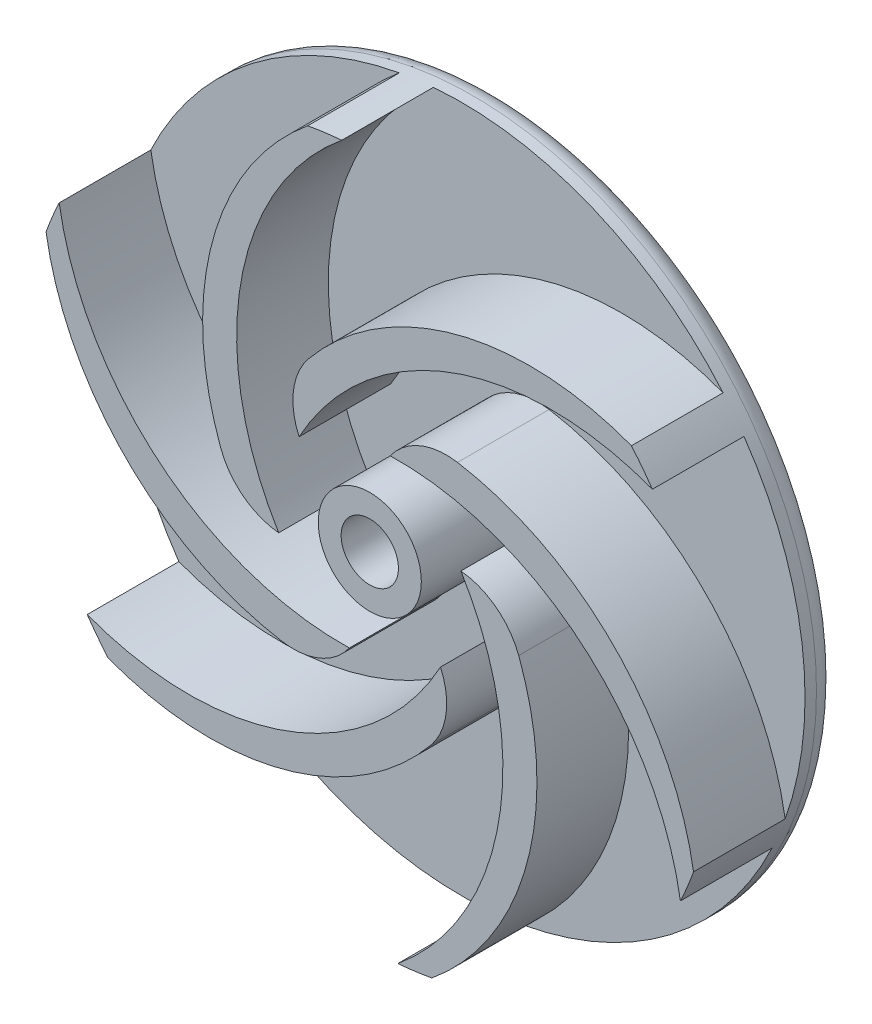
ISO-10303-21;
HEADER;
FILE_DESCRIPTION(('STEP AP214'),'2;1');
FILE_NAME('part.step','',(''),(''),'','','');
FILE_SCHEMA(('AUTOMOTIVE_DESIGN { 1 0 10303 214 1 1 1 1 }'));
ENDSEC;
DATA;
#1=APPLICATION_CONTEXT('core data for automotive mechanical design processes');
#2=APPLICATION_PROTOCOL_DEFINITION('international standard','automotive_design',2000,#1);
#3=PRODUCT_CONTEXT('',#1,'mechanical');
#4=PRODUCT('Part','Part','',(#3));
#5=PRODUCT_RELATED_PRODUCT_CATEGORY('part','',(#4));
#6=PRODUCT_DEFINITION_FORMATION('','',#4);
#7=PRODUCT_DEFINITION_CONTEXT('part definition',#1,'design');
#8=PRODUCT_DEFINITION('design','',#6,#7);
#9=PRODUCT_DEFINITION_SHAPE('','',#8);
#10=(LENGTH_UNIT() NAMED_UNIT(*) SI_UNIT(.MILLI.,.METRE.));
#11=(NAMED_UNIT(*) PLANE_ANGLE_UNIT() SI_UNIT($,.RADIAN.));
#12=(NAMED_UNIT(*) SI_UNIT($,.STERADIAN.) SOLID_ANGLE_UNIT());
#13=UNCERTAINTY_MEASURE_WITH_UNIT(LENGTH_MEASURE(1.E-05),#10,'distance_accuracy_value','');
#14=(GEOMETRIC_REPRESENTATION_CONTEXT(3) GLOBAL_UNCERTAINTY_ASSIGNED_CONTEXT((#13)) GLOBAL_UNIT_ASSIGNED_CONTEXT((#10,
#11,#12)) REPRESENTATION_CONTEXT('',''));
#15=CARTESIAN_POINT('',(0.,0.,0.));
#16=DIRECTION('',(0.,0.,1.));
#17=DIRECTION('',(1.,0.,0.));
#18=AXIS2_PLACEMENT_3D('',#15,#16,#17);
#19=CARTESIAN_POINT('',(0.,0.,1.5));
#20=DIRECTION('',(0.,0.,1.));
#21=DIRECTION('',(1.,0.,0.));
#22=AXIS2_PLACEMENT_3D('',#19,#20,#21);
#23=PLANE('',#22);
#24=CARTESIAN_POINT('',(0.,0.,1.5));
#25=DIRECTION('',(0.,0.,1.));
#26=DIRECTION('',(1.,0.,0.));
#27=AXIS2_PLACEMENT_3D('',#24,#25,#26);
#28=CIRCLE('',#27,2.25);
#29=CARTESIAN_POINT('',(2.25,0.,1.5));
#30=VERTEX_POINT('',#29);
#31=EDGE_CURVE('E334',#30,#30,#28,.T.);
#32=ORIENTED_EDGE('',*,*,#31,.F.);
#33=EDGE_LOOP('',(#32));
#34=FACE_BOUND('',#33,.T.);
#35=CARTESIAN_POINT('',(6.71906278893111,5.25914322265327,1.5));
#36=DIRECTION('',(0.,0.,-1.));
#37=DIRECTION('',(-0.50000000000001,-0.866025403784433,0.));
#38=AXIS2_PLACEMENT_3D('',#35,#36,#37);
#39=CIRCLE('',#38,12.5299640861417);
#40=CARTESIAN_POINT('',(-3.9770896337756,-1.26713621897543,1.5));
#41=VERTEX_POINT('',#40);
#42=CARTESIAN_POINT('',(-1.22368436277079,14.9500032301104,1.5));
#43=VERTEX_POINT('',#42);
#44=EDGE_CURVE('E758',#41,#43,#39,.T.);
#45=ORIENTED_EDGE('',*,*,#44,.F.);
#46=CARTESIAN_POINT('',(-3.69238428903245,1.7193237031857,1.5));
#47=DIRECTION('',(0.,0.,1.));
#48=DIRECTION('',(1.,0.,0.));
#49=AXIS2_PLACEMENT_3D('',#46,#47,#48);
#50=CIRCLE('',#49,3.);
#51=CARTESIAN_POINT('',(-6.5017658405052,0.667004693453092,1.5));
#52=VERTEX_POINT('',#51);
#53=EDGE_CURVE('E56',#41,#52,#50,.F.);
#54=ORIENTED_EDGE('',*,*,#53,.T.);
#55=CARTESIAN_POINT('',(5.23205080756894,5.06217782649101,1.5));
#56=DIRECTION('',(0.,0.,1.));
#57=DIRECTION('',(-0.50000000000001,-0.866025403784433,0.));
#58=AXIS2_PLACEMENT_3D('',#55,#56,#57);
#59=CIRCLE('',#58,12.5299640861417);
#60=CARTESIAN_POINT('',(-2.71069634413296,14.7530378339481,1.5));
#61=VERTEX_POINT('',#60);
#62=EDGE_CURVE('E452',#61,#52,#59,.T.);
#63=ORIENTED_EDGE('',*,*,#62,.F.);
#64=CARTESIAN_POINT('',(0.,0.,1.5));
#65=DIRECTION('',(0.,0.,1.));
#66=DIRECTION('',(1.,0.,0.));
#67=AXIS2_PLACEMENT_3D('',#64,#65,#66);
#68=CIRCLE('',#67,15.);
#69=CARTESIAN_POINT('',(-13.5589247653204,6.41525987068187,1.5));
#70=VERTEX_POINT('',#69);
#71=EDGE_CURVE('E352',#61,#70,#68,.T.);
#72=ORIENTED_EDGE('',*,*,#71,.T.);
#73=CARTESIAN_POINT('',(-1.19502023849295,8.44845067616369,1.5));
#74=DIRECTION('',(0.,0.,-1.));
#75=DIRECTION('',(0.499999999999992,-0.866025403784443,0.));
#76=AXIS2_PLACEMENT_3D('',#73,#74,#75);
#77=CIRCLE('',#76,12.5299640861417);
#78=CARTESIAN_POINT('',(-0.891172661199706,-4.07782876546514,1.5));
#79=VERTEX_POINT('',#78);
#80=EDGE_CURVE('E218',#79,#70,#77,.T.);
#81=ORIENTED_EDGE('',*,*,#80,.F.);
#82=CARTESIAN_POINT('',(-3.33517014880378,-2.33803674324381,1.5));
#83=DIRECTION('',(0.,0.,1.));
#84=DIRECTION('',(1.,0.,0.));
#85=AXIS2_PLACEMENT_3D('',#82,#83,#84);
#86=CIRCLE('',#85,3.);
#87=CARTESIAN_POINT('',(-3.82852592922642,-5.29719204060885,1.5));
#88=VERTEX_POINT('',#87);
#89=EDGE_CURVE('E380',#79,#88,#86,.F.);
#90=ORIENTED_EDGE('',*,*,#89,.T.);
#91=CARTESIAN_POINT('',(-1.76794919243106,7.06217782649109,1.5));
#92=DIRECTION('',(0.,0.,1.));
#93=DIRECTION('',(0.499999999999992,-0.866025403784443,0.));
#94=AXIS2_PLACEMENT_3D('',#91,#92,#93);
#95=CIRCLE('',#94,12.5299640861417);
#96=CARTESIAN_POINT('',(-14.1318537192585,5.02898702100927,1.5));
#97=VERTEX_POINT('',#96);
#98=EDGE_CURVE('E215',#97,#88,#95,.T.);
#99=ORIENTED_EDGE('',*,*,#98,.F.);
#100=CARTESIAN_POINT('',(-12.3352404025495,-8.5347433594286,1.5));
#101=VERTEX_POINT('',#100);
#102=EDGE_CURVE('E447',#97,#101,#68,.T.);
#103=ORIENTED_EDGE('',*,*,#102,.T.);
#104=CARTESIAN_POINT('',(-7.91408302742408,3.18930745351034,1.5));
#105=DIRECTION('',(0.,0.,-1.));
#106=DIRECTION('',(1.,0.,0.));
#107=AXIS2_PLACEMENT_3D('',#104,#105,#106);
#108=CIRCLE('',#107,12.5299640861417);
#109=CARTESIAN_POINT('',(3.08591697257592,-2.81069254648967,1.5));
#110=VERTEX_POINT('',#109);
#111=EDGE_CURVE('E247',#110,#101,#108,.T.);
#112=ORIENTED_EDGE('',*,*,#111,.F.);
#113=CARTESIAN_POINT('',(0.357214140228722,-4.0573604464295,1.5));
#114=DIRECTION('',(0.,0.,1.));
#115=DIRECTION('',(1.,0.,0.));
#116=AXIS2_PLACEMENT_3D('',#113,#114,#115);
#117=CIRCLE('',#116,3.);
#118=CARTESIAN_POINT('',(2.67323991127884,-5.9641967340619,1.5));
#119=VERTEX_POINT('',#118);
#120=EDGE_CURVE('E374',#110,#119,#117,.F.);
#121=ORIENTED_EDGE('',*,*,#120,.T.);
#122=CARTESIAN_POINT('',(-7.,2.,1.5));
#123=DIRECTION('',(0.,0.,1.));
#124=DIRECTION('',(1.,0.,0.));
#125=AXIS2_PLACEMENT_3D('',#122,#123,#124);
#126=CIRCLE('',#125,12.5299640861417);
#127=CARTESIAN_POINT('',(-11.4211573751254,-9.72405081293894,1.5));
#128=VERTEX_POINT('',#127);
#129=EDGE_CURVE('E242',#128,#119,#126,.T.);
#130=ORIENTED_EDGE('',*,*,#129,.F.);
#131=CARTESIAN_POINT('',(1.2236843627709,-14.9500032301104,1.5));
#132=VERTEX_POINT('',#131);
#133=EDGE_CURVE('E455',#128,#132,#68,.T.);
#134=ORIENTED_EDGE('',*,*,#133,.T.);
#135=CARTESIAN_POINT('',(-6.71906278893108,-5.25914322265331,1.5));
#136=DIRECTION('',(0.,0.,-1.));
#137=DIRECTION('',(0.500000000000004,0.866025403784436,0.));
#138=AXIS2_PLACEMENT_3D('',#135,#136,#137);
#139=CIRCLE('',#138,12.5299640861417);
#140=CARTESIAN_POINT('',(3.97708963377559,1.26713621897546,1.5));
#141=VERTEX_POINT('',#140);
#142=EDGE_CURVE('E269',#141,#132,#139,.T.);
#143=ORIENTED_EDGE('',*,*,#142,.F.);
#144=CARTESIAN_POINT('',(3.69238428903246,-1.71932370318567,1.5));
#145=DIRECTION('',(0.,0.,1.));
#146=DIRECTION('',(1.,0.,0.));
#147=AXIS2_PLACEMENT_3D('',#144,#145,#146);
#148=CIRCLE('',#147,3.);
#149=CARTESIAN_POINT('',(6.5017658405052,-0.667004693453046,1.5));
#150=VERTEX_POINT('',#149);
#151=EDGE_CURVE('E368',#141,#150,#148,.F.);
#152=ORIENTED_EDGE('',*,*,#151,.T.);
#153=CARTESIAN_POINT('',(-5.2320508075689,-5.06217782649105,1.5));
#154=DIRECTION('',(0.,0.,1.));
#155=DIRECTION('',(0.500000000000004,0.866025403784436,0.));
#156=AXIS2_PLACEMENT_3D('',#153,#154,#155);
#157=CIRCLE('',#156,12.5299640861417);
#158=CARTESIAN_POINT('',(2.71069634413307,-14.7530378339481,1.5));
#159=VERTEX_POINT('',#158);
#160=EDGE_CURVE('E264',#159,#150,#157,.T.);
#161=ORIENTED_EDGE('',*,*,#160,.F.);
#162=CARTESIAN_POINT('',(13.5589247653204,-6.41525987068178,1.5));
#163=VERTEX_POINT('',#162);
#164=EDGE_CURVE('E456',#159,#163,#68,.T.);
#165=ORIENTED_EDGE('',*,*,#164,.T.);
#166=CARTESIAN_POINT('',(1.19502023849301,-8.44845067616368,1.5));
#167=DIRECTION('',(0.,0.,-1.));
#168=DIRECTION('',(-0.499999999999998,0.86602540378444,0.));
#169=AXIS2_PLACEMENT_3D('',#166,#167,#168);
#170=CIRCLE('',#169,12.5299640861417);
#171=CARTESIAN_POINT('',(0.891172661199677,4.07782876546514,1.5));
#172=VERTEX_POINT('',#171);
#173=EDGE_CURVE('E291',#172,#163,#170,.T.);
#174=ORIENTED_EDGE('',*,*,#173,.F.);
#175=CARTESIAN_POINT('',(3.33517014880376,2.33803674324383,1.5));
#176=DIRECTION('',(0.,0.,1.));
#177=DIRECTION('',(1.,0.,0.));
#178=AXIS2_PLACEMENT_3D('',#175,#176,#177);
#179=CIRCLE('',#178,3.);
#180=CARTESIAN_POINT('',(3.82852592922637,5.29719204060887,1.5));
#181=VERTEX_POINT('',#180);
#182=EDGE_CURVE('E362',#172,#181,#179,.F.);
#183=ORIENTED_EDGE('',*,*,#182,.T.);
#184=CARTESIAN_POINT('',(1.76794919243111,-7.06217782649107,1.5));
#185=DIRECTION('',(0.,0.,1.));
#186=DIRECTION('',(-0.499999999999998,0.86602540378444,0.));
#187=AXIS2_PLACEMENT_3D('',#184,#185,#186);
#188=CIRCLE('',#187,12.5299640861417);
#189=CARTESIAN_POINT('',(14.1318537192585,-5.02898702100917,1.5));
#190=VERTEX_POINT('',#189);
#191=EDGE_CURVE('E286',#190,#181,#188,.T.);
#192=ORIENTED_EDGE('',*,*,#191,.F.);
#193=CARTESIAN_POINT('',(12.3352404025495,8.5347433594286,1.5));
#194=VERTEX_POINT('',#193);
#195=EDGE_CURVE('E348',#190,#194,#68,.T.);
#196=ORIENTED_EDGE('',*,*,#195,.T.);
#197=CARTESIAN_POINT('',(7.91408302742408,-3.18930745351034,1.5));
#198=DIRECTION('',(0.,0.,-1.));
#199=DIRECTION('',(-1.,0.,0.));
#200=AXIS2_PLACEMENT_3D('',#197,#198,#199);
#201=CIRCLE('',#200,12.5299640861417);
#202=CARTESIAN_POINT('',(-3.08591697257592,2.81069254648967,1.5));
#203=VERTEX_POINT('',#202);
#204=EDGE_CURVE('E313',#203,#194,#201,.T.);
#205=ORIENTED_EDGE('',*,*,#204,.F.);
#206=CARTESIAN_POINT('',(-0.357214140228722,4.0573604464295,1.5));
#207=DIRECTION('',(0.,0.,1.));
#208=DIRECTION('',(1.,0.,0.));
#209=AXIS2_PLACEMENT_3D('',#206,#207,#208);
#210=CIRCLE('',#209,3.);
#211=CARTESIAN_POINT('',(-2.67323991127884,5.9641967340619,1.5));
#212=VERTEX_POINT('',#211);
#213=EDGE_CURVE('E356',#203,#212,#210,.F.);
#214=ORIENTED_EDGE('',*,*,#213,.T.);
#215=CARTESIAN_POINT('',(7.,-2.,1.5));
#216=DIRECTION('',(0.,0.,1.));
#217=DIRECTION('',(-1.,0.,0.));
#218=AXIS2_PLACEMENT_3D('',#215,#216,#217);
#219=CIRCLE('',#218,12.5299640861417);
#220=CARTESIAN_POINT('',(11.4211573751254,9.72405081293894,1.5));
#221=VERTEX_POINT('',#220);
#222=EDGE_CURVE('E308',#221,#212,#219,.T.);
#223=ORIENTED_EDGE('',*,*,#222,.F.);
#224=EDGE_CURVE('E349',#221,#43,#68,.T.);
#225=ORIENTED_EDGE('',*,*,#224,.T.);
#226=EDGE_LOOP('',(#45,#54,#63,#72,#81,#90,#99,#103,#112,#121,#130,#134,#143,#152,#161,#165,
#174,#183,#192,#196,#205,#214,#223,#225));
#227=FACE_BOUND('',#226,.T.);
#228=ADVANCED_FACE('F33',(#34,#227),#23,.T.);
#229=CARTESIAN_POINT('',(0.,0.,0.));
#230=DIRECTION('',(0.,0.,1.));
#231=DIRECTION('',(1.,0.,0.));
#232=AXIS2_PLACEMENT_3D('',#229,#230,#231);
#233=PLANE('',#232);
#234=CARTESIAN_POINT('',(0.,0.,0.));
#235=DIRECTION('',(0.,0.,1.));
#236=DIRECTION('',(1.,0.,0.));
#237=AXIS2_PLACEMENT_3D('',#234,#235,#236);
#238=CIRCLE('',#237,14.);
#239=CARTESIAN_POINT('',(14.,0.,0.));
#240=VERTEX_POINT('',#239);
#241=EDGE_CURVE('E11',#240,#240,#238,.F.);
#242=ORIENTED_EDGE('',*,*,#241,.T.);
#243=EDGE_LOOP('',(#242));
#244=FACE_BOUND('',#243,.T.);
#245=CARTESIAN_POINT('',(0.,0.,0.));
#246=DIRECTION('',(0.,0.,1.));
#247=DIRECTION('',(1.,0.,0.));
#248=AXIS2_PLACEMENT_3D('',#245,#246,#247);
#249=CIRCLE('',#248,1.5);
#250=CARTESIAN_POINT('',(1.5,0.,0.));
#251=VERTEX_POINT('',#250);
#252=EDGE_CURVE('E345',#251,#251,#249,.T.);
#253=ORIENTED_EDGE('',*,*,#252,.T.);
#254=EDGE_LOOP('',(#253));
#255=FACE_BOUND('',#254,.T.);
#256=ADVANCED_FACE('F397',(#244,#255),#233,.F.);
#257=CARTESIAN_POINT('',(0.,0.,1.5));
#258=DIRECTION('',(0.,0.,-1.));
#259=DIRECTION('',(-1.,0.,0.));
#260=AXIS2_PLACEMENT_3D('',#257,#258,#259);
#261=CYLINDRICAL_SURFACE('',#260,15.);
#262=CARTESIAN_POINT('',(0.,0.,1.));
#263=DIRECTION('',(0.,0.,1.));
#264=DIRECTION('',(1.,0.,0.));
#265=AXIS2_PLACEMENT_3D('',#262,#263,#264);
#266=CIRCLE('',#265,15.);
#267=CARTESIAN_POINT('',(15.,0.,1.));
#268=VERTEX_POINT('',#267);
#269=EDGE_CURVE('E41',#268,#268,#266,.T.);
#270=ORIENTED_EDGE('',*,*,#269,.T.);
#271=EDGE_LOOP('',(#270));
#272=FACE_BOUND('',#271,.T.);
#273=ORIENTED_EDGE('',*,*,#224,.F.);
#274=DIRECTION('',(0.,0.,-1.));
#275=VECTOR('',#274,1.);
#276=CARTESIAN_POINT('',(11.4211573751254,9.72405081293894,5.5));
#277=LINE('',#276,#275);
#278=CARTESIAN_POINT('',(11.4211573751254,9.72405081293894,5.5));
#279=VERTEX_POINT('',#278);
#280=EDGE_CURVE('E317',#279,#221,#277,.T.);
#281=ORIENTED_EDGE('',*,*,#280,.F.);
#282=CARTESIAN_POINT('',(0.,0.,5.5));
#283=DIRECTION('',(0.,0.,1.));
#284=DIRECTION('',(-1.,0.,0.));
#285=AXIS2_PLACEMENT_3D('',#282,#283,#284);
#286=CIRCLE('',#285,15.);
#287=CARTESIAN_POINT('',(12.3352404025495,8.5347433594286,5.5));
#288=VERTEX_POINT('',#287);
#289=EDGE_CURVE('E315',#288,#279,#286,.T.);
#290=ORIENTED_EDGE('',*,*,#289,.F.);
#291=DIRECTION('',(0.,0.,-1.));
#292=VECTOR('',#291,1.);
#293=CARTESIAN_POINT('',(12.3352404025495,8.5347433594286,5.5));
#294=LINE('',#293,#292);
#295=EDGE_CURVE('E324',#288,#194,#294,.T.);
#296=ORIENTED_EDGE('',*,*,#295,.T.);
#297=ORIENTED_EDGE('',*,*,#195,.F.);
#298=DIRECTION('',(0.,0.,-1.));
#299=VECTOR('',#298,1.);
#300=CARTESIAN_POINT('',(14.1318537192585,-5.02898702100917,5.5));
#301=LINE('',#300,#299);
#302=CARTESIAN_POINT('',(14.1318537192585,-5.02898702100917,5.5));
#303=VERTEX_POINT('',#302);
#304=EDGE_CURVE('E295',#303,#190,#301,.T.);
#305=ORIENTED_EDGE('',*,*,#304,.F.);
#306=CARTESIAN_POINT('',(0.,0.,5.5));
#307=DIRECTION('',(0.,0.,1.));
#308=DIRECTION('',(-0.499999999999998,0.86602540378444,0.));
#309=AXIS2_PLACEMENT_3D('',#306,#307,#308);
#310=CIRCLE('',#309,15.);
#311=CARTESIAN_POINT('',(13.5589247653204,-6.41525987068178,5.5));
#312=VERTEX_POINT('',#311);
#313=EDGE_CURVE('E293',#312,#303,#310,.T.);
#314=ORIENTED_EDGE('',*,*,#313,.F.);
#315=DIRECTION('',(0.,0.,-1.));
#316=VECTOR('',#315,1.);
#317=CARTESIAN_POINT('',(13.5589247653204,-6.41525987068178,5.5));
#318=LINE('',#317,#316);
#319=EDGE_CURVE('E302',#312,#163,#318,.T.);
#320=ORIENTED_EDGE('',*,*,#319,.T.);
#321=ORIENTED_EDGE('',*,*,#164,.F.);
#322=DIRECTION('',(0.,0.,-1.));
#323=VECTOR('',#322,1.);
#324=CARTESIAN_POINT('',(2.71069634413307,-14.7530378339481,5.5));
#325=LINE('',#324,#323);
#326=CARTESIAN_POINT('',(2.71069634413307,-14.7530378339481,5.5));
#327=VERTEX_POINT('',#326);
#328=EDGE_CURVE('E273',#327,#159,#325,.T.);
#329=ORIENTED_EDGE('',*,*,#328,.F.);
#330=CARTESIAN_POINT('',(0.,0.,5.5));
#331=DIRECTION('',(0.,0.,1.));
#332=DIRECTION('',(0.500000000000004,0.866025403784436,0.));
#333=AXIS2_PLACEMENT_3D('',#330,#331,#332);
#334=CIRCLE('',#333,15.);
#335=CARTESIAN_POINT('',(1.2236843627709,-14.9500032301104,5.5));
#336=VERTEX_POINT('',#335);
#337=EDGE_CURVE('E271',#336,#327,#334,.T.);
#338=ORIENTED_EDGE('',*,*,#337,.F.);
#339=DIRECTION('',(0.,0.,-1.));
#340=VECTOR('',#339,1.);
#341=CARTESIAN_POINT('',(1.2236843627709,-14.9500032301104,5.5));
#342=LINE('',#341,#340);
#343=EDGE_CURVE('E280',#336,#132,#342,.T.);
#344=ORIENTED_EDGE('',*,*,#343,.T.);
#345=ORIENTED_EDGE('',*,*,#133,.F.);
#346=DIRECTION('',(0.,0.,-1.));
#347=VECTOR('',#346,1.);
#348=CARTESIAN_POINT('',(-11.4211573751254,-9.72405081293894,5.5));
#349=LINE('',#348,#347);
#350=CARTESIAN_POINT('',(-11.4211573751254,-9.72405081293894,5.5));
#351=VERTEX_POINT('',#350);
#352=EDGE_CURVE('E251',#351,#128,#349,.T.);
#353=ORIENTED_EDGE('',*,*,#352,.F.);
#354=CARTESIAN_POINT('',(0.,0.,5.5));
#355=DIRECTION('',(0.,0.,1.));
#356=DIRECTION('',(1.,0.,0.));
#357=AXIS2_PLACEMENT_3D('',#354,#355,#356);
#358=CIRCLE('',#357,15.);
#359=CARTESIAN_POINT('',(-12.3352404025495,-8.5347433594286,5.5));
#360=VERTEX_POINT('',#359);
#361=EDGE_CURVE('E249',#360,#351,#358,.T.);
#362=ORIENTED_EDGE('',*,*,#361,.F.);
#363=DIRECTION('',(0.,0.,-1.));
#364=VECTOR('',#363,1.);
#365=CARTESIAN_POINT('',(-12.3352404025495,-8.5347433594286,5.5));
#366=LINE('',#365,#364);
#367=EDGE_CURVE('E258',#360,#101,#366,.T.);
#368=ORIENTED_EDGE('',*,*,#367,.T.);
#369=ORIENTED_EDGE('',*,*,#102,.F.);
#370=DIRECTION('',(0.,0.,-1.));
#371=VECTOR('',#370,1.);
#372=CARTESIAN_POINT('',(-14.1318537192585,5.02898702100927,5.5));
#373=LINE('',#372,#371);
#374=CARTESIAN_POINT('',(-14.1318537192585,5.02898702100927,5.5));
#375=VERTEX_POINT('',#374);
#376=EDGE_CURVE('E230',#375,#97,#373,.T.);
#377=ORIENTED_EDGE('',*,*,#376,.F.);
#378=CARTESIAN_POINT('',(0.,0.,5.5));
#379=DIRECTION('',(0.,0.,1.));
#380=DIRECTION('',(0.499999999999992,-0.866025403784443,0.));
#381=AXIS2_PLACEMENT_3D('',#378,#379,#380);
#382=CIRCLE('',#381,15.);
#383=CARTESIAN_POINT('',(-13.5589247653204,6.41525987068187,5.5));
#384=VERTEX_POINT('',#383);
#385=EDGE_CURVE('E229',#384,#375,#382,.T.);
#386=ORIENTED_EDGE('',*,*,#385,.F.);
#387=DIRECTION('',(0.,0.,-1.));
#388=VECTOR('',#387,1.);
#389=CARTESIAN_POINT('',(-13.5589247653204,6.41525987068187,5.5));
#390=LINE('',#389,#388);
#391=EDGE_CURVE('E236',#384,#70,#390,.T.);
#392=ORIENTED_EDGE('',*,*,#391,.T.);
#393=ORIENTED_EDGE('',*,*,#71,.F.);
#394=DIRECTION('',(0.,0.,-1.));
#395=VECTOR('',#394,1.);
#396=CARTESIAN_POINT('',(-2.71069634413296,14.7530378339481,5.5));
#397=LINE('',#396,#395);
#398=CARTESIAN_POINT('',(-2.71069634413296,14.7530378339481,5.5));
#399=VERTEX_POINT('',#398);
#400=EDGE_CURVE('E220',#399,#61,#397,.T.);
#401=ORIENTED_EDGE('',*,*,#400,.F.);
#402=CARTESIAN_POINT('',(0.,0.,5.5));
#403=DIRECTION('',(0.,0.,1.));
#404=DIRECTION('',(-0.50000000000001,-0.866025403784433,0.));
#405=AXIS2_PLACEMENT_3D('',#402,#403,#404);
#406=CIRCLE('',#405,15.);
#407=CARTESIAN_POINT('',(-1.22368436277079,14.9500032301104,5.5));
#408=VERTEX_POINT('',#407);
#409=EDGE_CURVE('E212',#408,#399,#406,.T.);
#410=ORIENTED_EDGE('',*,*,#409,.F.);
#411=DIRECTION('',(0.,0.,-1.));
#412=VECTOR('',#411,1.);
#413=CARTESIAN_POINT('',(-1.22368436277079,14.9500032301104,5.5));
#414=LINE('',#413,#412);
#415=EDGE_CURVE('E210',#408,#43,#414,.T.);
#416=ORIENTED_EDGE('',*,*,#415,.T.);
#417=EDGE_LOOP('',(#273,#281,#290,#296,#297,#305,#314,#320,#321,#329,#338,#344,#345,#353,#362,
#368,#369,#377,#386,#392,#393,#401,#410,#416));
#418=FACE_BOUND('',#417,.T.);
#419=ADVANCED_FACE('F386',(#272,#418),#261,.T.);
#420=CARTESIAN_POINT('',(0.,0.,1.5));
#421=DIRECTION('',(0.,0.,-1.));
#422=DIRECTION('',(-1.,0.,0.));
#423=AXIS2_PLACEMENT_3D('',#420,#421,#422);
#424=CYLINDRICAL_SURFACE('',#423,1.5);
#425=CARTESIAN_POINT('',(0.,0.,1.5));
#426=DIRECTION('',(0.,0.,1.));
#427=DIRECTION('',(1.,0.,0.));
#428=AXIS2_PLACEMENT_3D('',#425,#426,#427);
#429=CIRCLE('',#428,1.5);
#430=CARTESIAN_POINT('',(1.5,0.,1.5));
#431=VERTEX_POINT('',#430);
#432=EDGE_CURVE('E340',#431,#431,#429,.T.);
#433=ORIENTED_EDGE('',*,*,#432,.T.);
#434=EDGE_LOOP('',(#433));
#435=FACE_BOUND('',#434,.T.);
#436=ORIENTED_EDGE('',*,*,#252,.F.);
#437=EDGE_LOOP('',(#436));
#438=FACE_BOUND('',#437,.T.);
#439=ADVANCED_FACE('F407',(#435,#438),#424,.F.);
#440=CARTESIAN_POINT('',(0.,0.,5.5));
#441=DIRECTION('',(0.,0.,1.));
#442=DIRECTION('',(1.,0.,0.));
#443=AXIS2_PLACEMENT_3D('',#440,#441,#442);
#444=PLANE('',#443);
#445=CARTESIAN_POINT('',(0.,0.,5.5));
#446=DIRECTION('',(0.,0.,1.));
#447=DIRECTION('',(1.,0.,0.));
#448=AXIS2_PLACEMENT_3D('',#445,#446,#447);
#449=CIRCLE('',#448,2.25);
#450=CARTESIAN_POINT('',(2.25,0.,5.5));
#451=VERTEX_POINT('',#450);
#452=EDGE_CURVE('E337',#451,#451,#449,.T.);
#453=ORIENTED_EDGE('',*,*,#452,.T.);
#454=EDGE_LOOP('',(#453));
#455=FACE_BOUND('',#454,.T.);
#456=CARTESIAN_POINT('',(0.,0.,5.5));
#457=DIRECTION('',(0.,0.,1.));
#458=DIRECTION('',(1.,0.,0.));
#459=AXIS2_PLACEMENT_3D('',#456,#457,#458);
#460=CIRCLE('',#459,1.25);
#461=CARTESIAN_POINT('',(1.25,0.,5.5));
#462=VERTEX_POINT('',#461);
#463=EDGE_CURVE('E331',#462,#462,#460,.T.);
#464=ORIENTED_EDGE('',*,*,#463,.F.);
#465=EDGE_LOOP('',(#464));
#466=FACE_BOUND('',#465,.T.);
#467=ADVANCED_FACE('F491',(#455,#466),#444,.T.);
#468=CARTESIAN_POINT('',(0.,0.,1.5));
#469=DIRECTION('',(0.,0.,1.));
#470=DIRECTION('',(1.,0.,0.));
#471=AXIS2_PLACEMENT_3D('',#468,#469,#470);
#472=PLANE('',#471);
#473=ORIENTED_EDGE('',*,*,#432,.F.);
#474=EDGE_LOOP('',(#473));
#475=FACE_BOUND('',#474,.T.);
#476=CARTESIAN_POINT('',(0.,0.,1.5));
#477=DIRECTION('',(0.,0.,1.));
#478=DIRECTION('',(1.,0.,0.));
#479=AXIS2_PLACEMENT_3D('',#476,#477,#478);
#480=CIRCLE('',#479,1.25);
#481=CARTESIAN_POINT('',(1.25,0.,1.5));
#482=VERTEX_POINT('',#481);
#483=EDGE_CURVE('E330',#482,#482,#480,.T.);
#484=ORIENTED_EDGE('',*,*,#483,.T.);
#485=EDGE_LOOP('',(#484));
#486=FACE_BOUND('',#485,.T.);
#487=ADVANCED_FACE('F494',(#475,#486),#472,.F.);
#488=CARTESIAN_POINT('',(0.,0.,5.5));
#489=DIRECTION('',(0.,0.,-1.));
#490=DIRECTION('',(-1.,0.,0.));
#491=AXIS2_PLACEMENT_3D('',#488,#489,#490);
#492=CYLINDRICAL_SURFACE('',#491,2.25);
#493=ORIENTED_EDGE('',*,*,#452,.F.);
#494=EDGE_LOOP('',(#493));
#495=FACE_BOUND('',#494,.T.);
#496=ORIENTED_EDGE('',*,*,#31,.T.);
#497=EDGE_LOOP('',(#496));
#498=FACE_BOUND('',#497,.T.);
#499=ADVANCED_FACE('F486',(#495,#498),#492,.T.);
#500=CARTESIAN_POINT('',(0.,0.,5.5));
#501=DIRECTION('',(0.,0.,-1.));
#502=DIRECTION('',(-1.,0.,0.));
#503=AXIS2_PLACEMENT_3D('',#500,#501,#502);
#504=CYLINDRICAL_SURFACE('',#503,1.25);
#505=ORIENTED_EDGE('',*,*,#463,.T.);
#506=EDGE_LOOP('',(#505));
#507=FACE_BOUND('',#506,.T.);
#508=ORIENTED_EDGE('',*,*,#483,.F.);
#509=EDGE_LOOP('',(#508));
#510=FACE_BOUND('',#509,.T.);
#511=ADVANCED_FACE('F479',(#507,#510),#504,.F.);
#512=CARTESIAN_POINT('',(7.,-2.,5.5));
#513=DIRECTION('',(0.,0.,-1.));
#514=DIRECTION('',(-1.,0.,0.));
#515=AXIS2_PLACEMENT_3D('',#512,#513,#514);
#516=CYLINDRICAL_SURFACE('',#515,12.5299640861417);
#517=ORIENTED_EDGE('',*,*,#222,.T.);
#518=DIRECTION('',(0.,0.,-1.));
#519=VECTOR('',#518,1.);
#520=CARTESIAN_POINT('',(-2.67323991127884,5.9641967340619,5.5));
#521=LINE('',#520,#519);
#522=CARTESIAN_POINT('',(-2.67323991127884,5.9641967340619,5.5));
#523=VERTEX_POINT('',#522);
#524=EDGE_CURVE('E351',#212,#523,#521,.F.);
#525=ORIENTED_EDGE('',*,*,#524,.T.);
#526=CARTESIAN_POINT('',(7.,-2.,5.5));
#527=DIRECTION('',(0.,0.,1.));
#528=DIRECTION('',(-1.,0.,0.));
#529=AXIS2_PLACEMENT_3D('',#526,#527,#528);
#530=CIRCLE('',#529,12.5299640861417);
#531=EDGE_CURVE('E309',#279,#523,#530,.T.);
#532=ORIENTED_EDGE('',*,*,#531,.F.);
#533=ORIENTED_EDGE('',*,*,#280,.T.);
#534=EDGE_LOOP('',(#517,#525,#532,#533));
#535=FACE_BOUND('',#534,.T.);
#536=ADVANCED_FACE('F477',(#535),#516,.T.);
#537=CARTESIAN_POINT('',(7.91408302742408,-3.18930745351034,5.5));
#538=DIRECTION('',(0.,0.,-1.));
#539=DIRECTION('',(-1.,0.,0.));
#540=AXIS2_PLACEMENT_3D('',#537,#538,#539);
#541=CYLINDRICAL_SURFACE('',#540,12.5299640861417);
#542=ORIENTED_EDGE('',*,*,#204,.T.);
#543=ORIENTED_EDGE('',*,*,#295,.F.);
#544=CARTESIAN_POINT('',(7.91408302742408,-3.18930745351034,5.5));
#545=DIRECTION('',(0.,0.,-1.));
#546=DIRECTION('',(-1.,0.,0.));
#547=AXIS2_PLACEMENT_3D('',#544,#545,#546);
#548=CIRCLE('',#547,12.5299640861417);
#549=CARTESIAN_POINT('',(-3.08591697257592,2.81069254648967,5.5));
#550=VERTEX_POINT('',#549);
#551=EDGE_CURVE('E312',#550,#288,#548,.T.);
#552=ORIENTED_EDGE('',*,*,#551,.F.);
#553=DIRECTION('',(0.,0.,-1.));
#554=VECTOR('',#553,1.);
#555=CARTESIAN_POINT('',(-3.08591697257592,2.81069254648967,5.5));
#556=LINE('',#555,#554);
#557=EDGE_CURVE('E327',#550,#203,#556,.T.);
#558=ORIENTED_EDGE('',*,*,#557,.T.);
#559=EDGE_LOOP('',(#542,#543,#552,#558));
#560=FACE_BOUND('',#559,.T.);
#561=ADVANCED_FACE('F466',(#560),#541,.F.);
#562=CARTESIAN_POINT('',(7.,-2.,5.5));
#563=DIRECTION('',(0.,0.,-1.));
#564=DIRECTION('',(-1.,0.,0.));
#565=AXIS2_PLACEMENT_3D('',#562,#563,#564);
#566=PLANE('',#565);
#567=ORIENTED_EDGE('',*,*,#531,.T.);
#568=CARTESIAN_POINT('',(-0.357214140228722,4.0573604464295,5.5));
#569=DIRECTION('',(0.,0.,-1.));
#570=DIRECTION('',(-1.,0.,0.));
#571=AXIS2_PLACEMENT_3D('',#568,#569,#570);
#572=CIRCLE('',#571,3.);
#573=EDGE_CURVE('E354',#523,#550,#572,.F.);
#574=ORIENTED_EDGE('',*,*,#573,.T.);
#575=ORIENTED_EDGE('',*,*,#551,.T.);
#576=ORIENTED_EDGE('',*,*,#289,.T.);
#577=EDGE_LOOP('',(#567,#574,#575,#576));
#578=FACE_BOUND('',#577,.T.);
#579=ADVANCED_FACE('F416',(#578),#566,.F.);
#580=CARTESIAN_POINT('',(-0.357214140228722,4.0573604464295,5.5));
#581=DIRECTION('',(0.,0.,1.));
#582=DIRECTION('',(1.,0.,0.));
#583=AXIS2_PLACEMENT_3D('',#580,#581,#582);
#584=CYLINDRICAL_SURFACE('',#583,3.);
#585=ORIENTED_EDGE('',*,*,#573,.F.);
#586=ORIENTED_EDGE('',*,*,#524,.F.);
#587=ORIENTED_EDGE('',*,*,#213,.F.);
#588=ORIENTED_EDGE('',*,*,#557,.F.);
#589=EDGE_LOOP('',(#585,#586,#587,#588));
#590=FACE_BOUND('',#589,.T.);
#591=ADVANCED_FACE('F412',(#590),#584,.T.);
#592=CARTESIAN_POINT('',(1.76794919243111,-7.06217782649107,5.5));
#593=DIRECTION('',(0.,0.,-1.));
#594=DIRECTION('',(-1.,0.,0.));
#595=AXIS2_PLACEMENT_3D('',#592,#593,#594);
#596=CYLINDRICAL_SURFACE('',#595,12.5299640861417);
#597=ORIENTED_EDGE('',*,*,#191,.T.);
#598=DIRECTION('',(0.,0.,-1.));
#599=VECTOR('',#598,1.);
#600=CARTESIAN_POINT('',(3.82852592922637,5.29719204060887,5.5));
#601=LINE('',#600,#599);
#602=CARTESIAN_POINT('',(3.82852592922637,5.29719204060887,5.5));
#603=VERTEX_POINT('',#602);
#604=EDGE_CURVE('E358',#181,#603,#601,.F.);
#605=ORIENTED_EDGE('',*,*,#604,.T.);
#606=CARTESIAN_POINT('',(1.76794919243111,-7.06217782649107,5.5));
#607=DIRECTION('',(0.,0.,1.));
#608=DIRECTION('',(-0.499999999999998,0.86602540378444,0.));
#609=AXIS2_PLACEMENT_3D('',#606,#607,#608);
#610=CIRCLE('',#609,12.5299640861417);
#611=EDGE_CURVE('E287',#303,#603,#610,.T.);
#612=ORIENTED_EDGE('',*,*,#611,.F.);
#613=ORIENTED_EDGE('',*,*,#304,.T.);
#614=EDGE_LOOP('',(#597,#605,#612,#613));
#615=FACE_BOUND('',#614,.T.);
#616=ADVANCED_FACE('F415',(#615),#596,.T.);
#617=CARTESIAN_POINT('',(1.19502023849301,-8.44845067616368,5.5));
#618=DIRECTION('',(0.,0.,-1.));
#619=DIRECTION('',(-1.,0.,0.));
#620=AXIS2_PLACEMENT_3D('',#617,#618,#619);
#621=CYLINDRICAL_SURFACE('',#620,12.5299640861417);
#622=ORIENTED_EDGE('',*,*,#173,.T.);
#623=ORIENTED_EDGE('',*,*,#319,.F.);
#624=CARTESIAN_POINT('',(1.19502023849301,-8.44845067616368,5.5));
#625=DIRECTION('',(0.,0.,-1.));
#626=DIRECTION('',(-0.499999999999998,0.86602540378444,0.));
#627=AXIS2_PLACEMENT_3D('',#624,#625,#626);
#628=CIRCLE('',#627,12.5299640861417);
#629=CARTESIAN_POINT('',(0.891172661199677,4.07782876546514,5.5));
#630=VERTEX_POINT('',#629);
#631=EDGE_CURVE('E290',#630,#312,#628,.T.);
#632=ORIENTED_EDGE('',*,*,#631,.F.);
#633=DIRECTION('',(0.,0.,-1.));
#634=VECTOR('',#633,1.);
#635=CARTESIAN_POINT('',(0.891172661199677,4.07782876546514,5.5));
#636=LINE('',#635,#634);
#637=EDGE_CURVE('E305',#630,#172,#636,.T.);
#638=ORIENTED_EDGE('',*,*,#637,.T.);
#639=EDGE_LOOP('',(#622,#623,#632,#638));
#640=FACE_BOUND('',#639,.T.);
#641=ADVANCED_FACE('F553',(#640),#621,.F.);
#642=CARTESIAN_POINT('',(1.76794919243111,-7.06217782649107,5.5));
#643=DIRECTION('',(0.,0.,-1.));
#644=DIRECTION('',(-0.499999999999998,0.86602540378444,0.));
#645=AXIS2_PLACEMENT_3D('',#642,#643,#644);
#646=PLANE('',#645);
#647=ORIENTED_EDGE('',*,*,#611,.T.);
#648=CARTESIAN_POINT('',(3.33517014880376,2.33803674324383,5.5));
#649=DIRECTION('',(0.,0.,-1.));
#650=DIRECTION('',(-1.,0.,0.));
#651=AXIS2_PLACEMENT_3D('',#648,#649,#650);
#652=CIRCLE('',#651,3.);
#653=EDGE_CURVE('E360',#603,#630,#652,.F.);
#654=ORIENTED_EDGE('',*,*,#653,.T.);
#655=ORIENTED_EDGE('',*,*,#631,.T.);
#656=ORIENTED_EDGE('',*,*,#313,.T.);
#657=EDGE_LOOP('',(#647,#654,#655,#656));
#658=FACE_BOUND('',#657,.T.);
#659=ADVANCED_FACE('F563',(#658),#646,.F.);
#660=CARTESIAN_POINT('',(-5.2320508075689,-5.06217782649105,5.5));
#661=DIRECTION('',(0.,0.,-1.));
#662=DIRECTION('',(-1.,0.,0.));
#663=AXIS2_PLACEMENT_3D('',#660,#661,#662);
#664=CYLINDRICAL_SURFACE('',#663,12.5299640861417);
#665=ORIENTED_EDGE('',*,*,#160,.T.);
#666=DIRECTION('',(0.,0.,-1.));
#667=VECTOR('',#666,1.);
#668=CARTESIAN_POINT('',(6.5017658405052,-0.667004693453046,5.5));
#669=LINE('',#668,#667);
#670=CARTESIAN_POINT('',(6.5017658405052,-0.667004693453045,5.5));
#671=VERTEX_POINT('',#670);
#672=EDGE_CURVE('E364',#150,#671,#669,.F.);
#673=ORIENTED_EDGE('',*,*,#672,.T.);
#674=CARTESIAN_POINT('',(-5.2320508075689,-5.06217782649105,5.5));
#675=DIRECTION('',(0.,0.,1.));
#676=DIRECTION('',(0.500000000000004,0.866025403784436,0.));
#677=AXIS2_PLACEMENT_3D('',#674,#675,#676);
#678=CIRCLE('',#677,12.5299640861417);
#679=EDGE_CURVE('E265',#327,#671,#678,.T.);
#680=ORIENTED_EDGE('',*,*,#679,.F.);
#681=ORIENTED_EDGE('',*,*,#328,.T.);
#682=EDGE_LOOP('',(#665,#673,#680,#681));
#683=FACE_BOUND('',#682,.T.);
#684=ADVANCED_FACE('F573',(#683),#664,.T.);
#685=CARTESIAN_POINT('',(-6.71906278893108,-5.25914322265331,5.5));
#686=DIRECTION('',(0.,0.,-1.));
#687=DIRECTION('',(-1.,0.,0.));
#688=AXIS2_PLACEMENT_3D('',#685,#686,#687);
#689=CYLINDRICAL_SURFACE('',#688,12.5299640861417);
#690=ORIENTED_EDGE('',*,*,#142,.T.);
#691=ORIENTED_EDGE('',*,*,#343,.F.);
#692=CARTESIAN_POINT('',(-6.71906278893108,-5.25914322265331,5.5));
#693=DIRECTION('',(0.,0.,-1.));
#694=DIRECTION('',(0.500000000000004,0.866025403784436,0.));
#695=AXIS2_PLACEMENT_3D('',#692,#693,#694);
#696=CIRCLE('',#695,12.5299640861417);
#697=CARTESIAN_POINT('',(3.97708963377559,1.26713621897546,5.5));
#698=VERTEX_POINT('',#697);
#699=EDGE_CURVE('E268',#698,#336,#696,.T.);
#700=ORIENTED_EDGE('',*,*,#699,.F.);
#701=DIRECTION('',(0.,0.,-1.));
#702=VECTOR('',#701,1.);
#703=CARTESIAN_POINT('',(3.97708963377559,1.26713621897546,5.5));
#704=LINE('',#703,#702);
#705=EDGE_CURVE('E283',#698,#141,#704,.T.);
#706=ORIENTED_EDGE('',*,*,#705,.T.);
#707=EDGE_LOOP('',(#690,#691,#700,#706));
#708=FACE_BOUND('',#707,.T.);
#709=ADVANCED_FACE('F583',(#708),#689,.F.);
#710=CARTESIAN_POINT('',(-5.2320508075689,-5.06217782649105,5.5));
#711=DIRECTION('',(0.,0.,-1.));
#712=DIRECTION('',(0.500000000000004,0.866025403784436,0.));
#713=AXIS2_PLACEMENT_3D('',#710,#711,#712);
#714=PLANE('',#713);
#715=ORIENTED_EDGE('',*,*,#679,.T.);
#716=CARTESIAN_POINT('',(3.69238428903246,-1.71932370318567,5.5));
#717=DIRECTION('',(0.,0.,-1.));
#718=DIRECTION('',(-1.,0.,0.));
#719=AXIS2_PLACEMENT_3D('',#716,#717,#718);
#720=CIRCLE('',#719,3.);
#721=EDGE_CURVE('E366',#671,#698,#720,.F.);
#722=ORIENTED_EDGE('',*,*,#721,.T.);
#723=ORIENTED_EDGE('',*,*,#699,.T.);
#724=ORIENTED_EDGE('',*,*,#337,.T.);
#725=EDGE_LOOP('',(#715,#722,#723,#724));
#726=FACE_BOUND('',#725,.T.);
#727=ADVANCED_FACE('F593',(#726),#714,.F.);
#728=CARTESIAN_POINT('',(-7.,2.,5.5));
#729=DIRECTION('',(0.,0.,-1.));
#730=DIRECTION('',(-1.,0.,0.));
#731=AXIS2_PLACEMENT_3D('',#728,#729,#730);
#732=CYLINDRICAL_SURFACE('',#731,12.5299640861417);
#733=ORIENTED_EDGE('',*,*,#129,.T.);
#734=DIRECTION('',(0.,0.,-1.));
#735=VECTOR('',#734,1.);
#736=CARTESIAN_POINT('',(2.67323991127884,-5.9641967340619,5.5));
#737=LINE('',#736,#735);
#738=CARTESIAN_POINT('',(2.67323991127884,-5.9641967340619,5.5));
#739=VERTEX_POINT('',#738);
#740=EDGE_CURVE('E370',#119,#739,#737,.F.);
#741=ORIENTED_EDGE('',*,*,#740,.T.);
#742=CARTESIAN_POINT('',(-7.,2.,5.5));
#743=DIRECTION('',(0.,0.,1.));
#744=DIRECTION('',(1.,0.,0.));
#745=AXIS2_PLACEMENT_3D('',#742,#743,#744);
#746=CIRCLE('',#745,12.5299640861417);
#747=EDGE_CURVE('E243',#351,#739,#746,.T.);
#748=ORIENTED_EDGE('',*,*,#747,.F.);
#749=ORIENTED_EDGE('',*,*,#352,.T.);
#750=EDGE_LOOP('',(#733,#741,#748,#749));
#751=FACE_BOUND('',#750,.T.);
#752=ADVANCED_FACE('F603',(#751),#732,.T.);
#753=CARTESIAN_POINT('',(-7.91408302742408,3.18930745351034,5.5));
#754=DIRECTION('',(0.,0.,-1.));
#755=DIRECTION('',(-1.,0.,0.));
#756=AXIS2_PLACEMENT_3D('',#753,#754,#755);
#757=CYLINDRICAL_SURFACE('',#756,12.5299640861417);
#758=ORIENTED_EDGE('',*,*,#111,.T.);
#759=ORIENTED_EDGE('',*,*,#367,.F.);
#760=CARTESIAN_POINT('',(-7.91408302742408,3.18930745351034,5.5));
#761=DIRECTION('',(0.,0.,-1.));
#762=DIRECTION('',(1.,0.,0.));
#763=AXIS2_PLACEMENT_3D('',#760,#761,#762);
#764=CIRCLE('',#763,12.5299640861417);
#765=CARTESIAN_POINT('',(3.08591697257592,-2.81069254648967,5.5));
#766=VERTEX_POINT('',#765);
#767=EDGE_CURVE('E246',#766,#360,#764,.T.);
#768=ORIENTED_EDGE('',*,*,#767,.F.);
#769=DIRECTION('',(0.,0.,-1.));
#770=VECTOR('',#769,1.);
#771=CARTESIAN_POINT('',(3.08591697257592,-2.81069254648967,5.5));
#772=LINE('',#771,#770);
#773=EDGE_CURVE('E261',#766,#110,#772,.T.);
#774=ORIENTED_EDGE('',*,*,#773,.T.);
#775=EDGE_LOOP('',(#758,#759,#768,#774));
#776=FACE_BOUND('',#775,.T.);
#777=ADVANCED_FACE('F613',(#776),#757,.F.);
#778=CARTESIAN_POINT('',(-7.,2.,5.5));
#779=DIRECTION('',(0.,0.,-1.));
#780=DIRECTION('',(1.,0.,0.));
#781=AXIS2_PLACEMENT_3D('',#778,#779,#780);
#782=PLANE('',#781);
#783=ORIENTED_EDGE('',*,*,#747,.T.);
#784=CARTESIAN_POINT('',(0.357214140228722,-4.0573604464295,5.5));
#785=DIRECTION('',(0.,0.,-1.));
#786=DIRECTION('',(-1.,0.,0.));
#787=AXIS2_PLACEMENT_3D('',#784,#785,#786);
#788=CIRCLE('',#787,3.);
#789=EDGE_CURVE('E372',#739,#766,#788,.F.);
#790=ORIENTED_EDGE('',*,*,#789,.T.);
#791=ORIENTED_EDGE('',*,*,#767,.T.);
#792=ORIENTED_EDGE('',*,*,#361,.T.);
#793=EDGE_LOOP('',(#783,#790,#791,#792));
#794=FACE_BOUND('',#793,.T.);
#795=ADVANCED_FACE('F623',(#794),#782,.F.);
#796=CARTESIAN_POINT('',(-1.76794919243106,7.06217782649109,5.5));
#797=DIRECTION('',(0.,0.,-1.));
#798=DIRECTION('',(-1.,0.,0.));
#799=AXIS2_PLACEMENT_3D('',#796,#797,#798);
#800=CYLINDRICAL_SURFACE('',#799,12.5299640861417);
#801=ORIENTED_EDGE('',*,*,#98,.T.);
#802=DIRECTION('',(0.,0.,-1.));
#803=VECTOR('',#802,1.);
#804=CARTESIAN_POINT('',(-3.82852592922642,-5.29719204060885,5.5));
#805=LINE('',#804,#803);
#806=CARTESIAN_POINT('',(-3.82852592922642,-5.29719204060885,5.5));
#807=VERTEX_POINT('',#806);
#808=EDGE_CURVE('E376',#88,#807,#805,.F.);
#809=ORIENTED_EDGE('',*,*,#808,.T.);
#810=CARTESIAN_POINT('',(-1.76794919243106,7.06217782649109,5.5));
#811=DIRECTION('',(0.,0.,1.));
#812=DIRECTION('',(0.499999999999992,-0.866025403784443,0.));
#813=AXIS2_PLACEMENT_3D('',#810,#811,#812);
#814=CIRCLE('',#813,12.5299640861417);
#815=EDGE_CURVE('E224',#375,#807,#814,.T.);
#816=ORIENTED_EDGE('',*,*,#815,.F.);
#817=ORIENTED_EDGE('',*,*,#376,.T.);
#818=EDGE_LOOP('',(#801,#809,#816,#817));
#819=FACE_BOUND('',#818,.T.);
#820=ADVANCED_FACE('F450',(#819),#800,.T.);
#821=CARTESIAN_POINT('',(-1.19502023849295,8.44845067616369,5.5));
#822=DIRECTION('',(0.,0.,-1.));
#823=DIRECTION('',(-1.,0.,0.));
#824=AXIS2_PLACEMENT_3D('',#821,#822,#823);
#825=CYLINDRICAL_SURFACE('',#824,12.5299640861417);
#826=ORIENTED_EDGE('',*,*,#80,.T.);
#827=ORIENTED_EDGE('',*,*,#391,.F.);
#828=CARTESIAN_POINT('',(-1.19502023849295,8.44845067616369,5.5));
#829=DIRECTION('',(0.,0.,-1.));
#830=DIRECTION('',(0.499999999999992,-0.866025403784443,0.));
#831=AXIS2_PLACEMENT_3D('',#828,#829,#830);
#832=CIRCLE('',#831,12.5299640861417);
#833=CARTESIAN_POINT('',(-0.891172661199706,-4.07782876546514,5.5));
#834=VERTEX_POINT('',#833);
#835=EDGE_CURVE('E227',#834,#384,#832,.T.);
#836=ORIENTED_EDGE('',*,*,#835,.F.);
#837=DIRECTION('',(0.,0.,-1.));
#838=VECTOR('',#837,1.);
#839=CARTESIAN_POINT('',(-0.891172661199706,-4.07782876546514,5.5));
#840=LINE('',#839,#838);
#841=EDGE_CURVE('E239',#834,#79,#840,.T.);
#842=ORIENTED_EDGE('',*,*,#841,.T.);
#843=EDGE_LOOP('',(#826,#827,#836,#842));
#844=FACE_BOUND('',#843,.T.);
#845=ADVANCED_FACE('F443',(#844),#825,.F.);
#846=CARTESIAN_POINT('',(-1.76794919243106,7.06217782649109,5.5));
#847=DIRECTION('',(0.,0.,-1.));
#848=DIRECTION('',(0.499999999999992,-0.866025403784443,0.));
#849=AXIS2_PLACEMENT_3D('',#846,#847,#848);
#850=PLANE('',#849);
#851=ORIENTED_EDGE('',*,*,#815,.T.);
#852=CARTESIAN_POINT('',(-3.33517014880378,-2.33803674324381,5.5));
#853=DIRECTION('',(0.,0.,-1.));
#854=DIRECTION('',(-1.,0.,0.));
#855=AXIS2_PLACEMENT_3D('',#852,#853,#854);
#856=CIRCLE('',#855,3.);
#857=EDGE_CURVE('E378',#807,#834,#856,.F.);
#858=ORIENTED_EDGE('',*,*,#857,.T.);
#859=ORIENTED_EDGE('',*,*,#835,.T.);
#860=ORIENTED_EDGE('',*,*,#385,.T.);
#861=EDGE_LOOP('',(#851,#858,#859,#860));
#862=FACE_BOUND('',#861,.T.);
#863=ADVANCED_FACE('F439',(#862),#850,.F.);
#864=CARTESIAN_POINT('',(5.23205080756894,5.06217782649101,5.5));
#865=DIRECTION('',(0.,0.,-1.));
#866=DIRECTION('',(-1.,0.,0.));
#867=AXIS2_PLACEMENT_3D('',#864,#865,#866);
#868=CYLINDRICAL_SURFACE('',#867,12.5299640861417);
#869=ORIENTED_EDGE('',*,*,#62,.T.);
#870=DIRECTION('',(0.,0.,-1.));
#871=VECTOR('',#870,1.);
#872=CARTESIAN_POINT('',(-6.5017658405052,0.667004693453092,5.5));
#873=LINE('',#872,#871);
#874=CARTESIAN_POINT('',(-6.50176584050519,0.667004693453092,5.5));
#875=VERTEX_POINT('',#874);
#876=EDGE_CURVE('E48',#52,#875,#873,.F.);
#877=ORIENTED_EDGE('',*,*,#876,.T.);
#878=CARTESIAN_POINT('',(5.23205080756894,5.06217782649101,5.5));
#879=DIRECTION('',(0.,0.,1.));
#880=DIRECTION('',(-0.50000000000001,-0.866025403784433,0.));
#881=AXIS2_PLACEMENT_3D('',#878,#879,#880);
#882=CIRCLE('',#881,12.5299640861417);
#883=EDGE_CURVE('E200',#399,#875,#882,.T.);
#884=ORIENTED_EDGE('',*,*,#883,.F.);
#885=ORIENTED_EDGE('',*,*,#400,.T.);
#886=EDGE_LOOP('',(#869,#877,#884,#885));
#887=FACE_BOUND('',#886,.T.);
#888=ADVANCED_FACE('F658',(#887),#868,.T.);
#889=CARTESIAN_POINT('',(6.71906278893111,5.25914322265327,5.5));
#890=DIRECTION('',(0.,0.,-1.));
#891=DIRECTION('',(-1.,0.,0.));
#892=AXIS2_PLACEMENT_3D('',#889,#890,#891);
#893=CYLINDRICAL_SURFACE('',#892,12.5299640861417);
#894=ORIENTED_EDGE('',*,*,#44,.T.);
#895=ORIENTED_EDGE('',*,*,#415,.F.);
#896=CARTESIAN_POINT('',(6.71906278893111,5.25914322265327,5.5));
#897=DIRECTION('',(0.,0.,-1.));
#898=DIRECTION('',(-0.50000000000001,-0.866025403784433,0.));
#899=AXIS2_PLACEMENT_3D('',#896,#897,#898);
#900=CIRCLE('',#899,12.5299640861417);
#901=CARTESIAN_POINT('',(-3.9770896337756,-1.26713621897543,5.5));
#902=VERTEX_POINT('',#901);
#903=EDGE_CURVE('E198',#902,#408,#900,.T.);
#904=ORIENTED_EDGE('',*,*,#903,.F.);
#905=DIRECTION('',(0.,0.,-1.));
#906=VECTOR('',#905,1.);
#907=CARTESIAN_POINT('',(-3.9770896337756,-1.26713621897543,5.5));
#908=LINE('',#907,#906);
#909=EDGE_CURVE('E208',#902,#41,#908,.T.);
#910=ORIENTED_EDGE('',*,*,#909,.T.);
#911=EDGE_LOOP('',(#894,#895,#904,#910));
#912=FACE_BOUND('',#911,.T.);
#913=ADVANCED_FACE('F207',(#912),#893,.F.);
#914=CARTESIAN_POINT('',(5.23205080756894,5.06217782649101,5.5));
#915=DIRECTION('',(0.,0.,-1.));
#916=DIRECTION('',(-0.50000000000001,-0.866025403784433,0.));
#917=AXIS2_PLACEMENT_3D('',#914,#915,#916);
#918=PLANE('',#917);
#919=ORIENTED_EDGE('',*,*,#883,.T.);
#920=CARTESIAN_POINT('',(-3.69238428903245,1.7193237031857,5.5));
#921=DIRECTION('',(0.,0.,-1.));
#922=DIRECTION('',(-1.,0.,0.));
#923=AXIS2_PLACEMENT_3D('',#920,#921,#922);
#924=CIRCLE('',#923,3.);
#925=EDGE_CURVE('E195',#875,#902,#924,.F.);
#926=ORIENTED_EDGE('',*,*,#925,.T.);
#927=ORIENTED_EDGE('',*,*,#903,.T.);
#928=ORIENTED_EDGE('',*,*,#409,.T.);
#929=EDGE_LOOP('',(#919,#926,#927,#928));
#930=FACE_BOUND('',#929,.T.);
#931=ADVANCED_FACE('F197',(#930),#918,.F.);
#932=CARTESIAN_POINT('',(3.33517014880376,2.33803674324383,5.5));
#933=DIRECTION('',(0.,0.,1.));
#934=DIRECTION('',(1.,0.,0.));
#935=AXIS2_PLACEMENT_3D('',#932,#933,#934);
#936=CYLINDRICAL_SURFACE('',#935,3.);
#937=ORIENTED_EDGE('',*,*,#653,.F.);
#938=ORIENTED_EDGE('',*,*,#604,.F.);
#939=ORIENTED_EDGE('',*,*,#182,.F.);
#940=ORIENTED_EDGE('',*,*,#637,.F.);
#941=EDGE_LOOP('',(#937,#938,#939,#940));
#942=FACE_BOUND('',#941,.T.);
#943=ADVANCED_FACE('F418',(#942),#936,.T.);
#944=CARTESIAN_POINT('',(3.69238428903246,-1.71932370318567,5.5));
#945=DIRECTION('',(0.,0.,1.));
#946=DIRECTION('',(1.,0.,0.));
#947=AXIS2_PLACEMENT_3D('',#944,#945,#946);
#948=CYLINDRICAL_SURFACE('',#947,3.);
#949=ORIENTED_EDGE('',*,*,#721,.F.);
#950=ORIENTED_EDGE('',*,*,#672,.F.);
#951=ORIENTED_EDGE('',*,*,#151,.F.);
#952=ORIENTED_EDGE('',*,*,#705,.F.);
#953=EDGE_LOOP('',(#949,#950,#951,#952));
#954=FACE_BOUND('',#953,.T.);
#955=ADVANCED_FACE('F421',(#954),#948,.T.);
#956=CARTESIAN_POINT('',(0.357214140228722,-4.0573604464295,5.5));
#957=DIRECTION('',(0.,0.,1.));
#958=DIRECTION('',(1.,0.,0.));
#959=AXIS2_PLACEMENT_3D('',#956,#957,#958);
#960=CYLINDRICAL_SURFACE('',#959,3.);
#961=ORIENTED_EDGE('',*,*,#789,.F.);
#962=ORIENTED_EDGE('',*,*,#740,.F.);
#963=ORIENTED_EDGE('',*,*,#120,.F.);
#964=ORIENTED_EDGE('',*,*,#773,.F.);
#965=EDGE_LOOP('',(#961,#962,#963,#964));
#966=FACE_BOUND('',#965,.T.);
#967=ADVANCED_FACE('F425',(#966),#960,.T.);
#968=CARTESIAN_POINT('',(-3.33517014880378,-2.33803674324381,5.5));
#969=DIRECTION('',(0.,0.,1.));
#970=DIRECTION('',(1.,0.,0.));
#971=AXIS2_PLACEMENT_3D('',#968,#969,#970);
#972=CYLINDRICAL_SURFACE('',#971,3.);
#973=ORIENTED_EDGE('',*,*,#857,.F.);
#974=ORIENTED_EDGE('',*,*,#808,.F.);
#975=ORIENTED_EDGE('',*,*,#89,.F.);
#976=ORIENTED_EDGE('',*,*,#841,.F.);
#977=EDGE_LOOP('',(#973,#974,#975,#976));
#978=FACE_BOUND('',#977,.T.);
#979=ADVANCED_FACE('F394',(#978),#972,.T.);
#980=CARTESIAN_POINT('',(-3.69238428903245,1.7193237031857,5.5));
#981=DIRECTION('',(0.,0.,1.));
#982=DIRECTION('',(1.,0.,0.));
#983=AXIS2_PLACEMENT_3D('',#980,#981,#982);
#984=CYLINDRICAL_SURFACE('',#983,3.);
#985=ORIENTED_EDGE('',*,*,#925,.F.);
#986=ORIENTED_EDGE('',*,*,#876,.F.);
#987=ORIENTED_EDGE('',*,*,#53,.F.);
#988=ORIENTED_EDGE('',*,*,#909,.F.);
#989=EDGE_LOOP('',(#985,#986,#987,#988));
#990=FACE_BOUND('',#989,.T.);
#991=ADVANCED_FACE('F214',(#990),#984,.T.);
#992=CARTESIAN_POINT('',(0.,0.,1.));
#993=DIRECTION('',(0.,0.,1.));
#994=DIRECTION('',(1.,0.,0.));
#995=AXIS2_PLACEMENT_3D('',#992,#993,#994);
#996=TOROIDAL_SURFACE('',#995,14.,1.);
#997=ORIENTED_EDGE('',*,*,#241,.F.);
#998=EDGE_LOOP('',(#997));
#999=FACE_BOUND('',#998,.T.);
#1000=ORIENTED_EDGE('',*,*,#269,.F.);
#1001=EDGE_LOOP('',(#1000));
#1002=FACE_BOUND('',#1001,.T.);
#1003=ADVANCED_FACE('F35',(#999,#1002),#996,.T.);
#1004=CLOSED_SHELL('',(#228,#256,#419,#439,#467,#487,#499,#511,#536,#561,#579,#591,#616,#641,
#659,#684,#709,#727,#752,#777,#795,#820,#845,#863,#888,#913,#931,#943,#955,#967,#979,#991,#1003));
#1005=MANIFOLD_SOLID_BREP('B2',#1004);
#1006=ADVANCED_BREP_SHAPE_REPRESENTATION('',(#18,#1005),#14);
#1007=SHAPE_DEFINITION_REPRESENTATION(#9,#1006);
ENDSEC;
END-ISO-10303-21;
